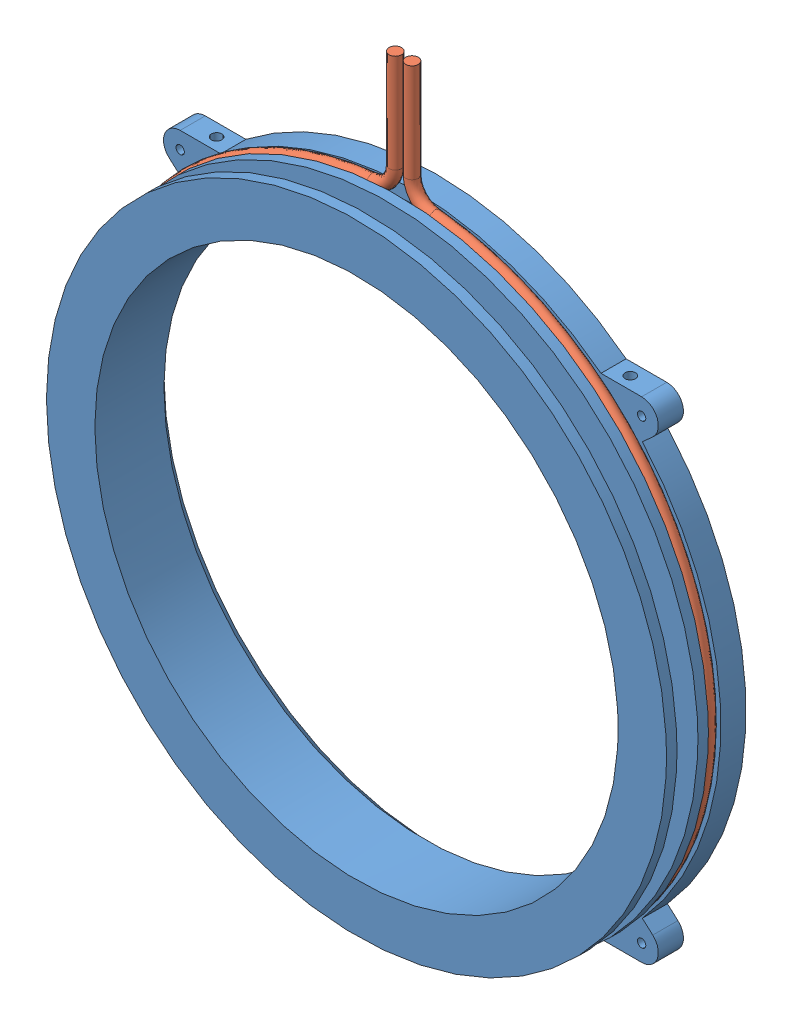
SolidWorks assembly 装配体2.sldasm, configuration 默认 (file format 12000). Lengths in mm.
Overall size (296.64 352.26 38).
2 component instances, 2 part files, 3 mates.
Components (placement in the parent):
- bias线圈支架_特氟龙-1: bias线圈支架_特氟龙.SLDPRT [默认] at (11.5616 15.4573 -19) size (296.2 296.2 38)
- 粗铜线圈_6mm-1: 粗铜线圈_6mm.SLDPRT [默认] at (11.1234 16.2191 -4) x (1 0 0) z (0 -1 0) size (296.2 6 351.5)
Mates (geometry in assembly coordinates):
- 平行1: parallel aligned: plane of bias线圈支架_特氟龙-1 through (102.3614 132.4573 -7) normal (0 1 0); plane of 粗铜线圈_6mm-1 through (15.1234 219.6165 -4) normal (0 1 0)
- 相切4: tangent: plane of bias线圈支架_特氟龙-1 through (11.5616 15.4573 -7) normal (0 0 1); circle of 粗铜线圈_6mm-1
- 相切5: tangent: plane of bias线圈支架_特氟龙-1 through (11.5616 15.4573 -7) normal (0 0 1); circle of 粗铜线圈_6mm-1
